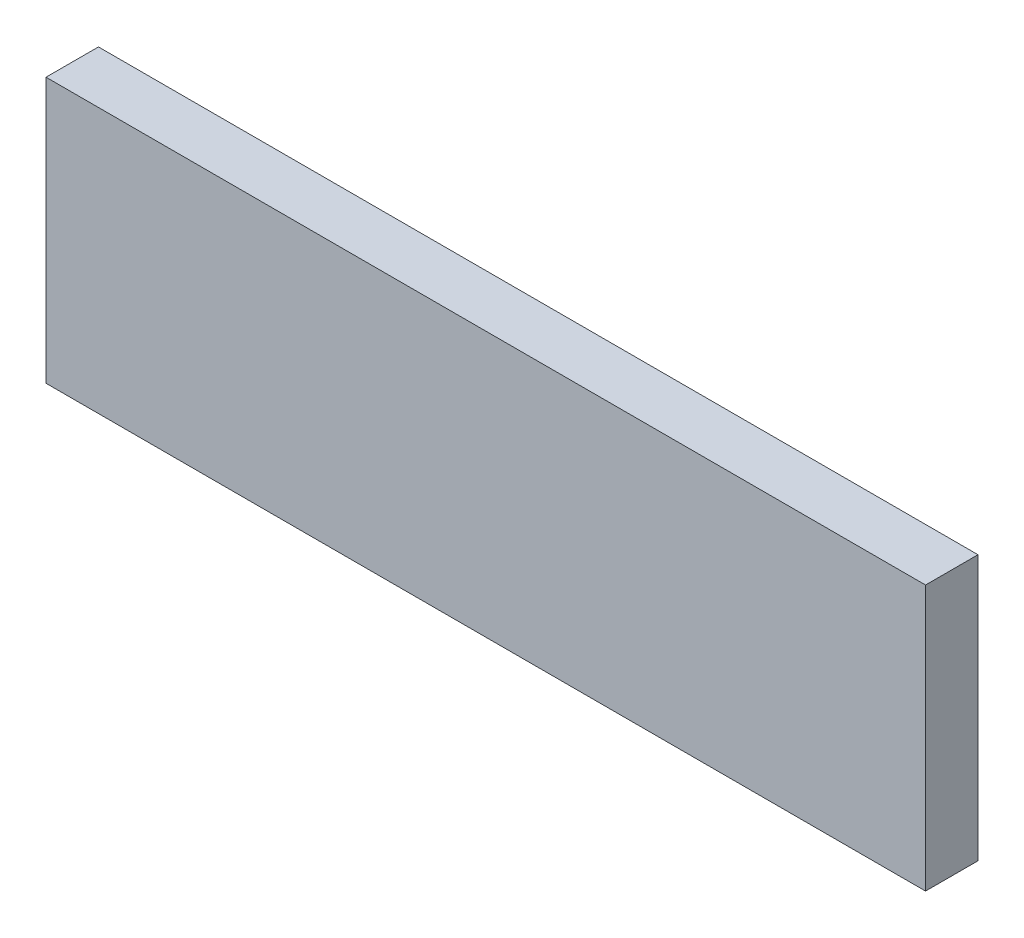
ISO-10303-21;
HEADER;
FILE_DESCRIPTION(('STEP AP214'),'2;1');
FILE_NAME('part.step','',(''),(''),'','','');
FILE_SCHEMA(('AUTOMOTIVE_DESIGN { 1 0 10303 214 1 1 1 1 }'));
ENDSEC;
DATA;
#1=APPLICATION_CONTEXT('core data for automotive mechanical design processes');
#2=APPLICATION_PROTOCOL_DEFINITION('international standard','automotive_design',2000,#1);
#3=PRODUCT_CONTEXT('',#1,'mechanical');
#4=PRODUCT('Part','Part','',(#3));
#5=PRODUCT_RELATED_PRODUCT_CATEGORY('part','',(#4));
#6=PRODUCT_DEFINITION_FORMATION('','',#4);
#7=PRODUCT_DEFINITION_CONTEXT('part definition',#1,'design');
#8=PRODUCT_DEFINITION('design','',#6,#7);
#9=PRODUCT_DEFINITION_SHAPE('','',#8);
#10=(LENGTH_UNIT() NAMED_UNIT(*) SI_UNIT(.MILLI.,.METRE.));
#11=(NAMED_UNIT(*) PLANE_ANGLE_UNIT() SI_UNIT($,.RADIAN.));
#12=(NAMED_UNIT(*) SI_UNIT($,.STERADIAN.) SOLID_ANGLE_UNIT());
#13=UNCERTAINTY_MEASURE_WITH_UNIT(LENGTH_MEASURE(1.E-05),#10,'distance_accuracy_value','');
#14=(GEOMETRIC_REPRESENTATION_CONTEXT(3) GLOBAL_UNCERTAINTY_ASSIGNED_CONTEXT((#13)) GLOBAL_UNIT_ASSIGNED_CONTEXT((#10,
#11,#12)) REPRESENTATION_CONTEXT('',''));
#15=CARTESIAN_POINT('',(0.,0.,0.));
#16=DIRECTION('',(0.,0.,1.));
#17=DIRECTION('',(1.,0.,0.));
#18=AXIS2_PLACEMENT_3D('',#15,#16,#17);
#19=CARTESIAN_POINT('',(83.8403022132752,-25.2686795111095,10.));
#20=DIRECTION('',(-1.,0.,0.));
#21=DIRECTION('',(0.,0.,1.));
#22=AXIS2_PLACEMENT_3D('',#19,#20,#21);
#23=PLANE('',#22);
#24=DIRECTION('',(0.,1.,0.));
#25=VECTOR('',#24,1.);
#26=CARTESIAN_POINT('',(83.8403022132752,-25.2686795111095,0.));
#27=LINE('',#26,#25);
#28=CARTESIAN_POINT('',(83.8403022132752,-25.2686795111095,0.));
#29=VERTEX_POINT('',#28);
#30=CARTESIAN_POINT('',(83.8403022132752,25.2686795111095,0.));
#31=VERTEX_POINT('',#30);
#32=EDGE_CURVE('E96',#29,#31,#27,.T.);
#33=ORIENTED_EDGE('',*,*,#32,.T.);
#34=DIRECTION('',(0.,0.,-1.));
#35=VECTOR('',#34,1.);
#36=CARTESIAN_POINT('',(83.8403022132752,25.2686795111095,10.));
#37=LINE('',#36,#35);
#38=CARTESIAN_POINT('',(83.8403022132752,25.2686795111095,10.));
#39=VERTEX_POINT('',#38);
#40=EDGE_CURVE('E11',#39,#31,#37,.T.);
#41=ORIENTED_EDGE('',*,*,#40,.F.);
#42=DIRECTION('',(0.,1.,0.));
#43=VECTOR('',#42,1.);
#44=CARTESIAN_POINT('',(83.8403022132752,-25.2686795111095,10.));
#45=LINE('',#44,#43);
#46=CARTESIAN_POINT('',(83.8403022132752,-25.2686795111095,10.));
#47=VERTEX_POINT('',#46);
#48=EDGE_CURVE('E84',#47,#39,#45,.T.);
#49=ORIENTED_EDGE('',*,*,#48,.F.);
#50=DIRECTION('',(0.,0.,-1.));
#51=VECTOR('',#50,1.);
#52=CARTESIAN_POINT('',(83.8403022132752,-25.2686795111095,10.));
#53=LINE('',#52,#51);
#54=EDGE_CURVE('E92',#47,#29,#53,.T.);
#55=ORIENTED_EDGE('',*,*,#54,.T.);
#56=EDGE_LOOP('',(#33,#41,#49,#55));
#57=FACE_BOUND('',#56,.T.);
#58=ADVANCED_FACE('F33',(#57),#23,.F.);
#59=CARTESIAN_POINT('',(-83.8403022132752,25.2686795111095,10.));
#60=DIRECTION('',(0.,-1.,0.));
#61=DIRECTION('',(0.,0.,-1.));
#62=AXIS2_PLACEMENT_3D('',#59,#60,#61);
#63=PLANE('',#62);
#64=DIRECTION('',(-1.,0.,0.));
#65=VECTOR('',#64,1.);
#66=CARTESIAN_POINT('',(-83.8403022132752,25.2686795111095,0.));
#67=LINE('',#66,#65);
#68=CARTESIAN_POINT('',(-83.8403022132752,25.2686795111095,0.));
#69=VERTEX_POINT('',#68);
#70=EDGE_CURVE('E88',#31,#69,#67,.T.);
#71=ORIENTED_EDGE('',*,*,#70,.T.);
#72=DIRECTION('',(0.,0.,-1.));
#73=VECTOR('',#72,1.);
#74=CARTESIAN_POINT('',(-83.8403022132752,25.2686795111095,10.));
#75=LINE('',#74,#73);
#76=CARTESIAN_POINT('',(-83.8403022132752,25.2686795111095,10.));
#77=VERTEX_POINT('',#76);
#78=EDGE_CURVE('E41',#77,#69,#75,.T.);
#79=ORIENTED_EDGE('',*,*,#78,.F.);
#80=DIRECTION('',(-1.,0.,0.));
#81=VECTOR('',#80,1.);
#82=CARTESIAN_POINT('',(-83.8403022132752,25.2686795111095,10.));
#83=LINE('',#82,#81);
#84=EDGE_CURVE('E79',#39,#77,#83,.T.);
#85=ORIENTED_EDGE('',*,*,#84,.F.);
#86=ORIENTED_EDGE('',*,*,#40,.T.);
#87=EDGE_LOOP('',(#71,#79,#85,#86));
#88=FACE_BOUND('',#87,.T.);
#89=ADVANCED_FACE('F87',(#88),#63,.F.);
#90=CARTESIAN_POINT('',(-83.8403022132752,-25.2686795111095,10.));
#91=DIRECTION('',(1.,0.,0.));
#92=DIRECTION('',(0.,0.,-1.));
#93=AXIS2_PLACEMENT_3D('',#90,#91,#92);
#94=PLANE('',#93);
#95=DIRECTION('',(0.,-1.,0.));
#96=VECTOR('',#95,1.);
#97=CARTESIAN_POINT('',(-83.8403022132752,-25.2686795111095,0.));
#98=LINE('',#97,#96);
#99=CARTESIAN_POINT('',(-83.8403022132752,-25.2686795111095,0.));
#100=VERTEX_POINT('',#99);
#101=EDGE_CURVE('E66',#69,#100,#98,.T.);
#102=ORIENTED_EDGE('',*,*,#101,.T.);
#103=DIRECTION('',(0.,0.,-1.));
#104=VECTOR('',#103,1.);
#105=CARTESIAN_POINT('',(-83.8403022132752,-25.2686795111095,10.));
#106=LINE('',#105,#104);
#107=CARTESIAN_POINT('',(-83.8403022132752,-25.2686795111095,10.));
#108=VERTEX_POINT('',#107);
#109=EDGE_CURVE('E89',#108,#100,#106,.T.);
#110=ORIENTED_EDGE('',*,*,#109,.F.);
#111=DIRECTION('',(0.,-1.,0.));
#112=VECTOR('',#111,1.);
#113=CARTESIAN_POINT('',(-83.8403022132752,-25.2686795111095,10.));
#114=LINE('',#113,#112);
#115=EDGE_CURVE('E82',#77,#108,#114,.T.);
#116=ORIENTED_EDGE('',*,*,#115,.F.);
#117=ORIENTED_EDGE('',*,*,#78,.T.);
#118=EDGE_LOOP('',(#102,#110,#116,#117));
#119=FACE_BOUND('',#118,.T.);
#120=ADVANCED_FACE('F90',(#119),#94,.F.);
#121=CARTESIAN_POINT('',(-83.8403022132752,-25.2686795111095,10.));
#122=DIRECTION('',(0.,1.,0.));
#123=DIRECTION('',(0.,0.,1.));
#124=AXIS2_PLACEMENT_3D('',#121,#122,#123);
#125=PLANE('',#124);
#126=DIRECTION('',(1.,0.,0.));
#127=VECTOR('',#126,1.);
#128=CARTESIAN_POINT('',(-83.8403022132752,-25.2686795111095,0.));
#129=LINE('',#128,#127);
#130=EDGE_CURVE('E72',#100,#29,#129,.T.);
#131=ORIENTED_EDGE('',*,*,#130,.T.);
#132=ORIENTED_EDGE('',*,*,#54,.F.);
#133=DIRECTION('',(1.,0.,0.));
#134=VECTOR('',#133,1.);
#135=CARTESIAN_POINT('',(-83.8403022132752,-25.2686795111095,10.));
#136=LINE('',#135,#134);
#137=EDGE_CURVE('E49',#108,#47,#136,.T.);
#138=ORIENTED_EDGE('',*,*,#137,.F.);
#139=ORIENTED_EDGE('',*,*,#109,.T.);
#140=EDGE_LOOP('',(#131,#132,#138,#139));
#141=FACE_BOUND('',#140,.T.);
#142=ADVANCED_FACE('F103',(#141),#125,.F.);
#143=CARTESIAN_POINT('',(83.8403022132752,25.2686795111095,10.));
#144=DIRECTION('',(0.,0.,-1.));
#145=DIRECTION('',(-1.,0.,0.));
#146=AXIS2_PLACEMENT_3D('',#143,#144,#145);
#147=PLANE('',#146);
#148=ORIENTED_EDGE('',*,*,#48,.T.);
#149=ORIENTED_EDGE('',*,*,#84,.T.);
#150=ORIENTED_EDGE('',*,*,#115,.T.);
#151=ORIENTED_EDGE('',*,*,#137,.T.);
#152=EDGE_LOOP('',(#148,#149,#150,#151));
#153=FACE_BOUND('',#152,.T.);
#154=ADVANCED_FACE('F80',(#153),#147,.F.);
#155=CARTESIAN_POINT('',(83.8403022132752,25.2686795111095,0.));
#156=DIRECTION('',(0.,0.,-1.));
#157=DIRECTION('',(-1.,0.,0.));
#158=AXIS2_PLACEMENT_3D('',#155,#156,#157);
#159=PLANE('',#158);
#160=ORIENTED_EDGE('',*,*,#32,.F.);
#161=ORIENTED_EDGE('',*,*,#130,.F.);
#162=ORIENTED_EDGE('',*,*,#101,.F.);
#163=ORIENTED_EDGE('',*,*,#70,.F.);
#164=EDGE_LOOP('',(#160,#161,#162,#163));
#165=FACE_BOUND('',#164,.T.);
#166=ADVANCED_FACE('F106',(#165),#159,.T.);
#167=CLOSED_SHELL('',(#58,#89,#120,#142,#154,#166));
#168=MANIFOLD_SOLID_BREP('B2',#167);
#169=ADVANCED_BREP_SHAPE_REPRESENTATION('',(#18,#168),#14);
#170=SHAPE_DEFINITION_REPRESENTATION(#9,#169);
ENDSEC;
END-ISO-10303-21;
